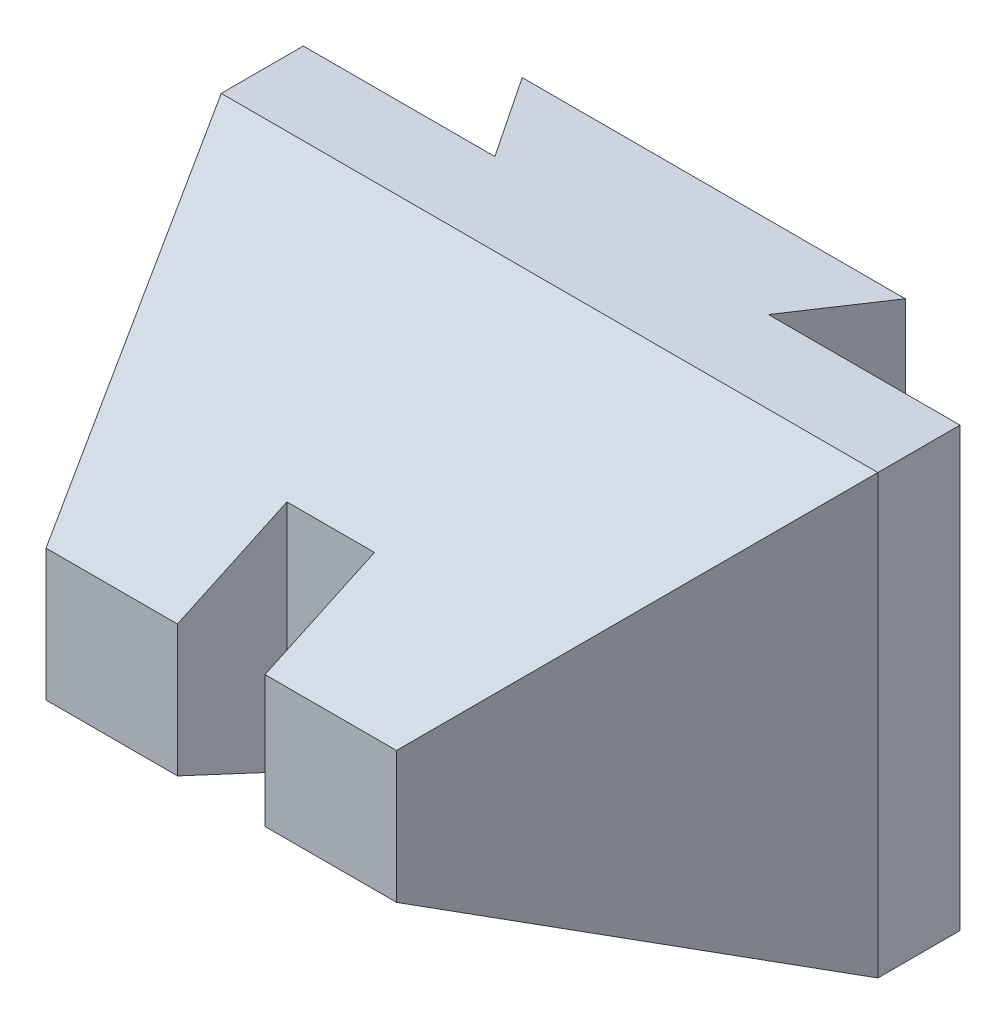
from build123d import *

# Parameters (mm, degrees)
SKETCH_1_W          = 120
SKETCH_1_H          = 80
EXTRUDE_1_DEPTH     = 60
EXTRUDE_1_TAPER     = 25
SKETCH_2_W          = 120
SKETCH_2_H          = 80
EXTRUDE_2_DEPTH     = 30
CUT_EXTRUDE_1_DEPTH = 117.619037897
SKETCH_4_W          = 16
SKETCH_4_H          = 50
CUT_EXTRUDE_2_DEPTH = 20


with BuildPart() as part:
    # Sketch 1 → Extrude 1 (new body)
    with BuildSketch(Plane.XY):
        Rectangle(SKETCH_1_W, SKETCH_1_H)
    extrude(amount=EXTRUDE_1_DEPTH, taper=EXTRUDE_1_TAPER)

    # Sketch 2 → Extrude 2 (add)
    with BuildSketch(Plane(origin=(0, 0, 0), x_dir=(-1, 0, 0), z_dir=(0, 0, -1))):
        Rectangle(SKETCH_2_W, SKETCH_2_H)
    extrude(amount=EXTRUDE_2_DEPTH)

    # Sketch 3 → Cut-Extrude 1 (cut, through all)
    with BuildSketch(Plane(origin=(0, 40, 0), x_dir=(1, 0, 0), z_dir=(0, 1, 0))):
        Polygon((-60, 15), (-25, 15), (-35, 30), (-60, 30), align=None)
    cut_extrude_1 = extrude(amount=-CUT_EXTRUDE_1_DEPTH, mode=Mode.SUBTRACT)

    # Mirror 1: Cut-Extrude 1 across plane
    add(cut_extrude_1.mirror(Plane(origin=(0, 0, 0), x_dir=(0, 0, 1), z_dir=(1, 0, 0))), mode=Mode.SUBTRACT)

    # Sketch 4 → Cut-Extrude 2 (cut)
    with BuildSketch(Plane.XY.offset(60)):
        Rectangle(SKETCH_4_W, SKETCH_4_H)
    extrude(amount=-CUT_EXTRUDE_2_DEPTH, mode=Mode.SUBTRACT)


solid = part.part
